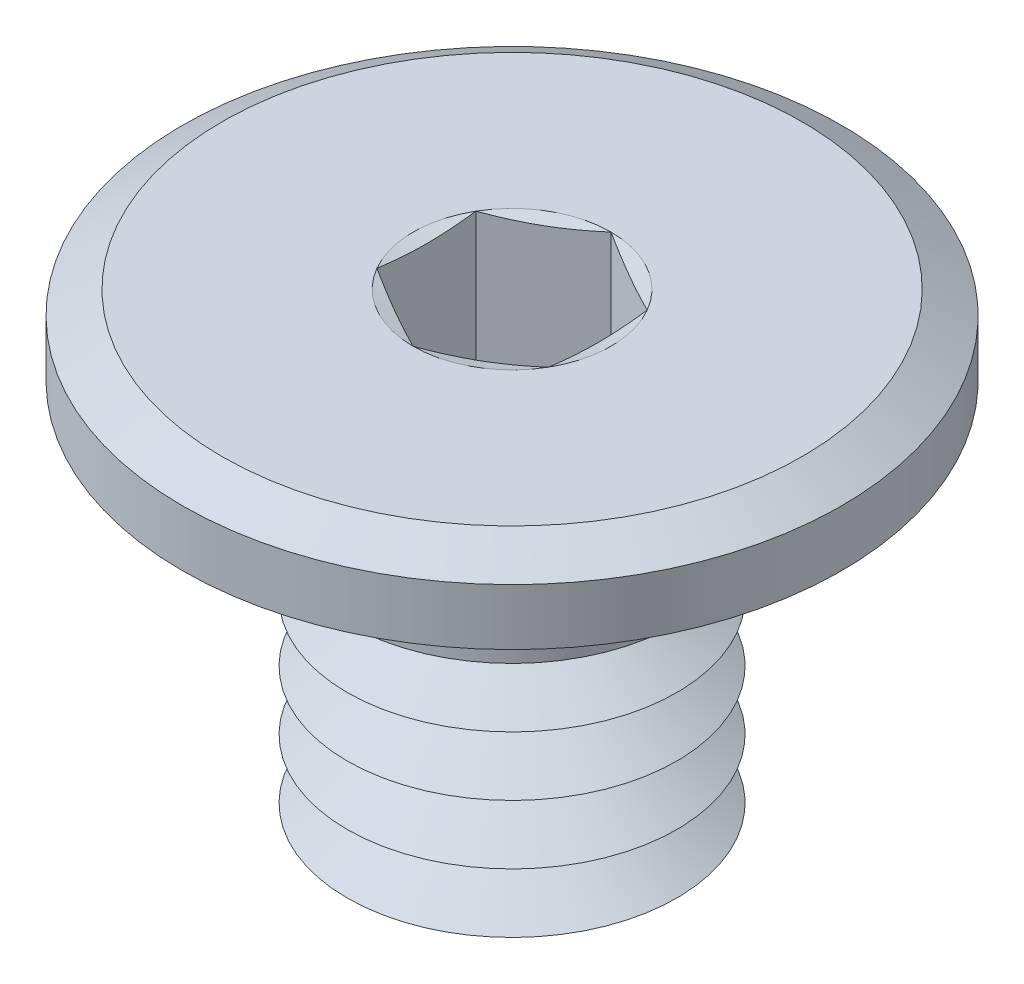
from build123d import *

# Parameters (mm, degrees)
SKETCH1_R           = 2.5
BOSS_EXTRUDE1_DEPTH = 0.6
SKETCH2_R           = 1.25
BOSS_EXTRUDE2_DEPTH = 3
LPATTERN1_COUNT     = 5
LPATTERN1_PITCH     = 0.45
FILLET1_R           = 0.1
CHAMFER2_SIZE       = 0.3
CHAMFER2_SIZE2      = 0.173205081
CUT_EXTRUDE1_DEPTH  = 1.2


with BuildPart() as part:
    # Sketch1 → Boss-Extrude1 (new body)
    with BuildSketch(Plane(origin=(0, 0, 0), x_dir=(1, 0, 0), z_dir=(0, 1, 0))):
        with Locations(Location((0, 0, 0), (0, 0, 270))):
            Circle(SKETCH1_R)
    extrude(amount=-BOSS_EXTRUDE1_DEPTH)

    # Sketch2 → Boss-Extrude2 (add)
    with BuildSketch(Plane.XZ.offset(0.6)):
        with Locations(Location((0, 0, 0), (0, 0, 270))):
            Circle(SKETCH2_R)
    extrude(amount=BOSS_EXTRUDE2_DEPTH)

    # Sketch5 → Cut-Revolve1 (revolve, cut)
    with BuildSketch(Plane(origin=(0, 0, 0), x_dir=(0, 0, -1), z_dir=(1, 0, 0))):
        Polygon((-1.25, -3.825), (-0.860288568, -3.6), (-1.25, -3.375), align=None)
    cut_revolve1 = revolve(axis=Axis((0, 0.990593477, 0), (0, -1, 0)), mode=Mode.SUBTRACT)

    # LPattern1: Cut-Revolve1 ×5
    with Locations(*[(0, i * LPATTERN1_PITCH, 0) for i in range(1, LPATTERN1_COUNT)]):
        add(cut_revolve1, mode=Mode.SUBTRACT)

    # Fillet1
    fillet1_edges = [part.edges().sort_by_distance(p)[0] for p in [
        (0, -0.6, 1.25),
    ]]
    fillet(fillet1_edges, radius=FILLET1_R)

    # Chamfer2
    chamfer2_edges = [part.edges().sort_by_distance(p)[0] for p in [
        (0, 0, -2.5),
    ]]
    chamfer2_side = [part.faces().sort_by_distance(p)[0] for p in [
        (0, 0, 0),
    ]]
    chamfer(chamfer2_edges, length=CHAMFER2_SIZE, length2=CHAMFER2_SIZE2, reference=chamfer2_side[0])

    # Sketch6 → Cut-Extrude1 (cut)
    with BuildSketch(Plane(origin=(0, 0, 0), x_dir=(1, 0, 0), z_dir=(0, 1, 0))):
        Polygon((0, 0.75055535), (-0.65, 0.375277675), (-0.65, -0.375277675), (0, -0.75055535), (0.65, -0.375277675), (0.65, 0.375277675), align=None)
    extrude(amount=-CUT_EXTRUDE1_DEPTH, mode=Mode.SUBTRACT)

    # Cut-Extrude2 cone 1 section (on through the dimple's axis) → Cut-Extrude2 (revolve, cut)
    with BuildSketch(Plane(origin=(0, -1.2, 0), x_dir=(0, 0, 1), z_dir=(1, 0, 0))):
        Polygon((0, 0), (0.65, 0), (0, 0.375277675), align=None)
    revolve(axis=Axis((0, -1.2, 0), (0, -1, 0)), mode=Mode.SUBTRACT)

    # Cut-Extrude3 cone 1 section (on through the dimple's axis) → Cut-Extrude3 (revolve, cut)
    with BuildSketch(Plane(origin=(0, 0, 0), x_dir=(0, 0, 1), z_dir=(1, 0, 0))):
        Polygon((0, 0), (0.75055535, 0), (0, 0.2011107), align=None)
    revolve(axis=Axis((0, 0, 0), (0, -1, 0)), mode=Mode.SUBTRACT)


solid = part.part
